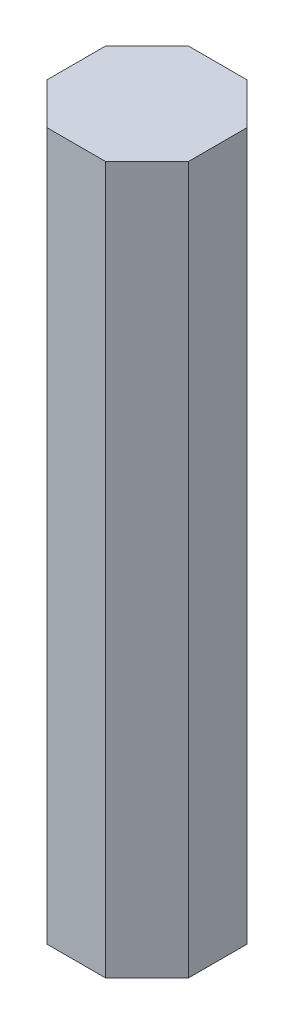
ISO-10303-21;
HEADER;
FILE_DESCRIPTION(('STEP AP214'),'2;1');
FILE_NAME('part.step','',(''),(''),'','','');
FILE_SCHEMA(('AUTOMOTIVE_DESIGN { 1 0 10303 214 1 1 1 1 }'));
ENDSEC;
DATA;
#1=APPLICATION_CONTEXT('core data for automotive mechanical design processes');
#2=APPLICATION_PROTOCOL_DEFINITION('international standard','automotive_design',2000,#1);
#3=PRODUCT_CONTEXT('',#1,'mechanical');
#4=PRODUCT('Part','Part','',(#3));
#5=PRODUCT_RELATED_PRODUCT_CATEGORY('part','',(#4));
#6=PRODUCT_DEFINITION_FORMATION('','',#4);
#7=PRODUCT_DEFINITION_CONTEXT('part definition',#1,'design');
#8=PRODUCT_DEFINITION('design','',#6,#7);
#9=PRODUCT_DEFINITION_SHAPE('','',#8);
#10=(LENGTH_UNIT() NAMED_UNIT(*) SI_UNIT(.MILLI.,.METRE.));
#11=(NAMED_UNIT(*) PLANE_ANGLE_UNIT() SI_UNIT($,.RADIAN.));
#12=(NAMED_UNIT(*) SI_UNIT($,.STERADIAN.) SOLID_ANGLE_UNIT());
#13=UNCERTAINTY_MEASURE_WITH_UNIT(LENGTH_MEASURE(1.E-05),#10,'distance_accuracy_value','');
#14=(GEOMETRIC_REPRESENTATION_CONTEXT(3) GLOBAL_UNCERTAINTY_ASSIGNED_CONTEXT((#13)) GLOBAL_UNIT_ASSIGNED_CONTEXT((#10,
#11,#12)) REPRESENTATION_CONTEXT('',''));
#15=CARTESIAN_POINT('',(0.,0.,0.));
#16=DIRECTION('',(0.,0.,1.));
#17=DIRECTION('',(1.,0.,0.));
#18=AXIS2_PLACEMENT_3D('',#15,#16,#17);
#19=CARTESIAN_POINT('',(-41.4213562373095,1000.,100.));
#20=DIRECTION('',(0.,0.,-1.));
#21=DIRECTION('',(-1.,0.,0.));
#22=AXIS2_PLACEMENT_3D('',#19,#20,#21);
#23=PLANE('',#22);
#24=DIRECTION('',(1.,0.,0.));
#25=VECTOR('',#24,1.);
#26=CARTESIAN_POINT('',(-41.4213562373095,0.,100.));
#27=LINE('',#26,#25);
#28=CARTESIAN_POINT('',(-41.4213562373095,0.,100.));
#29=VERTEX_POINT('',#28);
#30=CARTESIAN_POINT('',(41.4213562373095,0.,100.));
#31=VERTEX_POINT('',#30);
#32=EDGE_CURVE('E128',#29,#31,#27,.T.);
#33=ORIENTED_EDGE('',*,*,#32,.T.);
#34=DIRECTION('',(0.,-1.,0.));
#35=VECTOR('',#34,1.);
#36=CARTESIAN_POINT('',(41.4213562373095,1000.,100.));
#37=LINE('',#36,#35);
#38=CARTESIAN_POINT('',(41.4213562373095,1000.,100.));
#39=VERTEX_POINT('',#38);
#40=EDGE_CURVE('E11',#39,#31,#37,.T.);
#41=ORIENTED_EDGE('',*,*,#40,.F.);
#42=DIRECTION('',(1.,0.,0.));
#43=VECTOR('',#42,1.);
#44=CARTESIAN_POINT('',(-41.4213562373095,1000.,100.));
#45=LINE('',#44,#43);
#46=CARTESIAN_POINT('',(-41.4213562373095,1000.,100.));
#47=VERTEX_POINT('',#46);
#48=EDGE_CURVE('E142',#47,#39,#45,.T.);
#49=ORIENTED_EDGE('',*,*,#48,.F.);
#50=DIRECTION('',(0.,-1.,0.));
#51=VECTOR('',#50,1.);
#52=CARTESIAN_POINT('',(-41.4213562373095,1000.,100.));
#53=LINE('',#52,#51);
#54=EDGE_CURVE('E124',#47,#29,#53,.T.);
#55=ORIENTED_EDGE('',*,*,#54,.T.);
#56=EDGE_LOOP('',(#33,#41,#49,#55));
#57=FACE_BOUND('',#56,.T.);
#58=ADVANCED_FACE('F32',(#57),#23,.F.);
#59=CARTESIAN_POINT('',(41.4213562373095,1000.,100.));
#60=DIRECTION('',(-0.707106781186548,0.,-0.707106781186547));
#61=DIRECTION('',(-0.707106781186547,0.,0.707106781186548));
#62=AXIS2_PLACEMENT_3D('',#59,#60,#61);
#63=PLANE('',#62);
#64=DIRECTION('',(0.707106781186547,0.,-0.707106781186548));
#65=VECTOR('',#64,1.);
#66=CARTESIAN_POINT('',(41.4213562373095,0.,100.));
#67=LINE('',#66,#65);
#68=CARTESIAN_POINT('',(100.,0.,41.4213562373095));
#69=VERTEX_POINT('',#68);
#70=EDGE_CURVE('E131',#31,#69,#67,.T.);
#71=ORIENTED_EDGE('',*,*,#70,.T.);
#72=DIRECTION('',(0.,-1.,0.));
#73=VECTOR('',#72,1.);
#74=CARTESIAN_POINT('',(100.,1000.,41.4213562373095));
#75=LINE('',#74,#73);
#76=CARTESIAN_POINT('',(100.,1000.,41.4213562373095));
#77=VERTEX_POINT('',#76);
#78=EDGE_CURVE('E40',#77,#69,#75,.T.);
#79=ORIENTED_EDGE('',*,*,#78,.F.);
#80=DIRECTION('',(0.707106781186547,0.,-0.707106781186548));
#81=VECTOR('',#80,1.);
#82=CARTESIAN_POINT('',(41.4213562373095,1000.,100.));
#83=LINE('',#82,#81);
#84=EDGE_CURVE('E91',#39,#77,#83,.T.);
#85=ORIENTED_EDGE('',*,*,#84,.F.);
#86=ORIENTED_EDGE('',*,*,#40,.T.);
#87=EDGE_LOOP('',(#71,#79,#85,#86));
#88=FACE_BOUND('',#87,.T.);
#89=ADVANCED_FACE('F177',(#88),#63,.F.);
#90=CARTESIAN_POINT('',(100.,1000.,41.4213562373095));
#91=DIRECTION('',(-1.,0.,0.));
#92=DIRECTION('',(0.,0.,1.));
#93=AXIS2_PLACEMENT_3D('',#90,#91,#92);
#94=PLANE('',#93);
#95=DIRECTION('',(0.,0.,-1.));
#96=VECTOR('',#95,1.);
#97=CARTESIAN_POINT('',(100.,0.,41.4213562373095));
#98=LINE('',#97,#96);
#99=CARTESIAN_POINT('',(100.,0.,-41.4213562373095));
#100=VERTEX_POINT('',#99);
#101=EDGE_CURVE('E133',#69,#100,#98,.T.);
#102=ORIENTED_EDGE('',*,*,#101,.T.);
#103=DIRECTION('',(0.,-1.,0.));
#104=VECTOR('',#103,1.);
#105=CARTESIAN_POINT('',(100.,1000.,-41.4213562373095));
#106=LINE('',#105,#104);
#107=CARTESIAN_POINT('',(100.,1000.,-41.4213562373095));
#108=VERTEX_POINT('',#107);
#109=EDGE_CURVE('E149',#108,#100,#106,.T.);
#110=ORIENTED_EDGE('',*,*,#109,.F.);
#111=DIRECTION('',(0.,0.,-1.));
#112=VECTOR('',#111,1.);
#113=CARTESIAN_POINT('',(100.,1000.,41.4213562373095));
#114=LINE('',#113,#112);
#115=EDGE_CURVE('E157',#77,#108,#114,.T.);
#116=ORIENTED_EDGE('',*,*,#115,.F.);
#117=ORIENTED_EDGE('',*,*,#78,.T.);
#118=EDGE_LOOP('',(#102,#110,#116,#117));
#119=FACE_BOUND('',#118,.T.);
#120=ADVANCED_FACE('F155',(#119),#94,.F.);
#121=CARTESIAN_POINT('',(100.,1000.,-41.4213562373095));
#122=DIRECTION('',(-0.707106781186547,0.,0.707106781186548));
#123=DIRECTION('',(0.707106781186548,0.,0.707106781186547));
#124=AXIS2_PLACEMENT_3D('',#121,#122,#123);
#125=PLANE('',#124);
#126=DIRECTION('',(-0.707106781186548,0.,-0.707106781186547));
#127=VECTOR('',#126,1.);
#128=CARTESIAN_POINT('',(100.,0.,-41.4213562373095));
#129=LINE('',#128,#127);
#130=CARTESIAN_POINT('',(41.4213562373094,0.,-100.));
#131=VERTEX_POINT('',#130);
#132=EDGE_CURVE('E135',#100,#131,#129,.T.);
#133=ORIENTED_EDGE('',*,*,#132,.T.);
#134=DIRECTION('',(0.,-1.,0.));
#135=VECTOR('',#134,1.);
#136=CARTESIAN_POINT('',(41.4213562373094,1000.,-100.));
#137=LINE('',#136,#135);
#138=CARTESIAN_POINT('',(41.4213562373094,1000.,-100.));
#139=VERTEX_POINT('',#138);
#140=EDGE_CURVE('E146',#139,#131,#137,.T.);
#141=ORIENTED_EDGE('',*,*,#140,.F.);
#142=DIRECTION('',(-0.707106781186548,0.,-0.707106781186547));
#143=VECTOR('',#142,1.);
#144=CARTESIAN_POINT('',(100.,1000.,-41.4213562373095));
#145=LINE('',#144,#143);
#146=EDGE_CURVE('E169',#108,#139,#145,.T.);
#147=ORIENTED_EDGE('',*,*,#146,.F.);
#148=ORIENTED_EDGE('',*,*,#109,.T.);
#149=EDGE_LOOP('',(#133,#141,#147,#148));
#150=FACE_BOUND('',#149,.T.);
#151=ADVANCED_FACE('F165',(#150),#125,.F.);
#152=CARTESIAN_POINT('',(41.4213562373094,1000.,-100.));
#153=DIRECTION('',(0.,0.,1.));
#154=DIRECTION('',(1.,0.,0.));
#155=AXIS2_PLACEMENT_3D('',#152,#153,#154);
#156=PLANE('',#155);
#157=DIRECTION('',(-1.,0.,0.));
#158=VECTOR('',#157,1.);
#159=CARTESIAN_POINT('',(41.4213562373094,0.,-100.));
#160=LINE('',#159,#158);
#161=CARTESIAN_POINT('',(-41.4213562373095,0.,-100.));
#162=VERTEX_POINT('',#161);
#163=EDGE_CURVE('E137',#131,#162,#160,.T.);
#164=ORIENTED_EDGE('',*,*,#163,.T.);
#165=DIRECTION('',(0.,-1.,0.));
#166=VECTOR('',#165,1.);
#167=CARTESIAN_POINT('',(-41.4213562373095,1000.,-100.));
#168=LINE('',#167,#166);
#169=CARTESIAN_POINT('',(-41.4213562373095,1000.,-100.));
#170=VERTEX_POINT('',#169);
#171=EDGE_CURVE('E119',#170,#162,#168,.T.);
#172=ORIENTED_EDGE('',*,*,#171,.F.);
#173=DIRECTION('',(-1.,0.,0.));
#174=VECTOR('',#173,1.);
#175=CARTESIAN_POINT('',(41.4213562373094,1000.,-100.));
#176=LINE('',#175,#174);
#177=EDGE_CURVE('E110',#139,#170,#176,.T.);
#178=ORIENTED_EDGE('',*,*,#177,.F.);
#179=ORIENTED_EDGE('',*,*,#140,.T.);
#180=EDGE_LOOP('',(#164,#172,#178,#179));
#181=FACE_BOUND('',#180,.T.);
#182=ADVANCED_FACE('F168',(#181),#156,.F.);
#183=CARTESIAN_POINT('',(-41.4213562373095,1000.,-100.));
#184=DIRECTION('',(0.707106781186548,0.,0.707106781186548));
#185=DIRECTION('',(0.707106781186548,0.,-0.707106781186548));
#186=AXIS2_PLACEMENT_3D('',#183,#184,#185);
#187=PLANE('',#186);
#188=DIRECTION('',(-0.707106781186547,0.,0.707106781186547));
#189=VECTOR('',#188,1.);
#190=CARTESIAN_POINT('',(-41.4213562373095,0.,-100.));
#191=LINE('',#190,#189);
#192=CARTESIAN_POINT('',(-100.,0.,-41.4213562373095));
#193=VERTEX_POINT('',#192);
#194=EDGE_CURVE('E118',#162,#193,#191,.T.);
#195=ORIENTED_EDGE('',*,*,#194,.T.);
#196=DIRECTION('',(0.,-1.,0.));
#197=VECTOR('',#196,1.);
#198=CARTESIAN_POINT('',(-100.,1000.,-41.4213562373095));
#199=LINE('',#198,#197);
#200=CARTESIAN_POINT('',(-100.,1000.,-41.4213562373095));
#201=VERTEX_POINT('',#200);
#202=EDGE_CURVE('E115',#201,#193,#199,.T.);
#203=ORIENTED_EDGE('',*,*,#202,.F.);
#204=DIRECTION('',(-0.707106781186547,0.,0.707106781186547));
#205=VECTOR('',#204,1.);
#206=CARTESIAN_POINT('',(-41.4213562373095,1000.,-100.));
#207=LINE('',#206,#205);
#208=EDGE_CURVE('E104',#170,#201,#207,.T.);
#209=ORIENTED_EDGE('',*,*,#208,.F.);
#210=ORIENTED_EDGE('',*,*,#171,.T.);
#211=EDGE_LOOP('',(#195,#203,#209,#210));
#212=FACE_BOUND('',#211,.T.);
#213=ADVANCED_FACE('F116',(#212),#187,.F.);
#214=CARTESIAN_POINT('',(-100.,1000.,-41.4213562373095));
#215=DIRECTION('',(1.,0.,0.));
#216=DIRECTION('',(0.,0.,-1.));
#217=AXIS2_PLACEMENT_3D('',#214,#215,#216);
#218=PLANE('',#217);
#219=DIRECTION('',(0.,0.,1.));
#220=VECTOR('',#219,1.);
#221=CARTESIAN_POINT('',(-100.,0.,-41.4213562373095));
#222=LINE('',#221,#220);
#223=CARTESIAN_POINT('',(-100.,0.,41.4213562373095));
#224=VERTEX_POINT('',#223);
#225=EDGE_CURVE('E77',#193,#224,#222,.T.);
#226=ORIENTED_EDGE('',*,*,#225,.T.);
#227=DIRECTION('',(0.,-1.,0.));
#228=VECTOR('',#227,1.);
#229=CARTESIAN_POINT('',(-100.,1000.,41.4213562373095));
#230=LINE('',#229,#228);
#231=CARTESIAN_POINT('',(-100.,1000.,41.4213562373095));
#232=VERTEX_POINT('',#231);
#233=EDGE_CURVE('E120',#232,#224,#230,.T.);
#234=ORIENTED_EDGE('',*,*,#233,.F.);
#235=DIRECTION('',(0.,0.,1.));
#236=VECTOR('',#235,1.);
#237=CARTESIAN_POINT('',(-100.,1000.,-41.4213562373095));
#238=LINE('',#237,#236);
#239=EDGE_CURVE('E108',#201,#232,#238,.T.);
#240=ORIENTED_EDGE('',*,*,#239,.F.);
#241=ORIENTED_EDGE('',*,*,#202,.T.);
#242=EDGE_LOOP('',(#226,#234,#240,#241));
#243=FACE_BOUND('',#242,.T.);
#244=ADVANCED_FACE('F122',(#243),#218,.F.);
#245=CARTESIAN_POINT('',(-100.,1000.,41.4213562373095));
#246=DIRECTION('',(0.707106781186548,0.,-0.707106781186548));
#247=DIRECTION('',(-0.707106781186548,0.,-0.707106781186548));
#248=AXIS2_PLACEMENT_3D('',#245,#246,#247);
#249=PLANE('',#248);
#250=DIRECTION('',(0.707106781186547,0.,0.707106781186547));
#251=VECTOR('',#250,1.);
#252=CARTESIAN_POINT('',(-100.,0.,41.4213562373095));
#253=LINE('',#252,#251);
#254=EDGE_CURVE('E83',#224,#29,#253,.T.);
#255=ORIENTED_EDGE('',*,*,#254,.T.);
#256=ORIENTED_EDGE('',*,*,#54,.F.);
#257=DIRECTION('',(0.707106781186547,0.,0.707106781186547));
#258=VECTOR('',#257,1.);
#259=CARTESIAN_POINT('',(-100.,1000.,41.4213562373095));
#260=LINE('',#259,#258);
#261=EDGE_CURVE('E48',#232,#47,#260,.T.);
#262=ORIENTED_EDGE('',*,*,#261,.F.);
#263=ORIENTED_EDGE('',*,*,#233,.T.);
#264=EDGE_LOOP('',(#255,#256,#262,#263));
#265=FACE_BOUND('',#264,.T.);
#266=ADVANCED_FACE('F193',(#265),#249,.F.);
#267=CARTESIAN_POINT('',(0.,1000.,0.));
#268=DIRECTION('',(0.,1.,0.));
#269=DIRECTION('',(0.,0.,1.));
#270=AXIS2_PLACEMENT_3D('',#267,#268,#269);
#271=PLANE('',#270);
#272=ORIENTED_EDGE('',*,*,#48,.T.);
#273=ORIENTED_EDGE('',*,*,#84,.T.);
#274=ORIENTED_EDGE('',*,*,#115,.T.);
#275=ORIENTED_EDGE('',*,*,#146,.T.);
#276=ORIENTED_EDGE('',*,*,#177,.T.);
#277=ORIENTED_EDGE('',*,*,#208,.T.);
#278=ORIENTED_EDGE('',*,*,#239,.T.);
#279=ORIENTED_EDGE('',*,*,#261,.T.);
#280=EDGE_LOOP('',(#272,#273,#274,#275,#276,#277,#278,#279));
#281=FACE_BOUND('',#280,.T.);
#282=ADVANCED_FACE('F106',(#281),#271,.T.);
#283=CARTESIAN_POINT('',(0.,0.,0.));
#284=DIRECTION('',(0.,1.,0.));
#285=DIRECTION('',(0.,0.,1.));
#286=AXIS2_PLACEMENT_3D('',#283,#284,#285);
#287=PLANE('',#286);
#288=ORIENTED_EDGE('',*,*,#32,.F.);
#289=ORIENTED_EDGE('',*,*,#254,.F.);
#290=ORIENTED_EDGE('',*,*,#225,.F.);
#291=ORIENTED_EDGE('',*,*,#194,.F.);
#292=ORIENTED_EDGE('',*,*,#163,.F.);
#293=ORIENTED_EDGE('',*,*,#132,.F.);
#294=ORIENTED_EDGE('',*,*,#101,.F.);
#295=ORIENTED_EDGE('',*,*,#70,.F.);
#296=EDGE_LOOP('',(#288,#289,#290,#291,#292,#293,#294,#295));
#297=FACE_BOUND('',#296,.T.);
#298=ADVANCED_FACE('F161',(#297),#287,.F.);
#299=CLOSED_SHELL('',(#58,#89,#120,#151,#182,#213,#244,#266,#282,#298));
#300=MANIFOLD_SOLID_BREP('B2',#299);
#301=ADVANCED_BREP_SHAPE_REPRESENTATION('',(#18,#300),#14);
#302=SHAPE_DEFINITION_REPRESENTATION(#9,#301);
ENDSEC;
END-ISO-10303-21;
